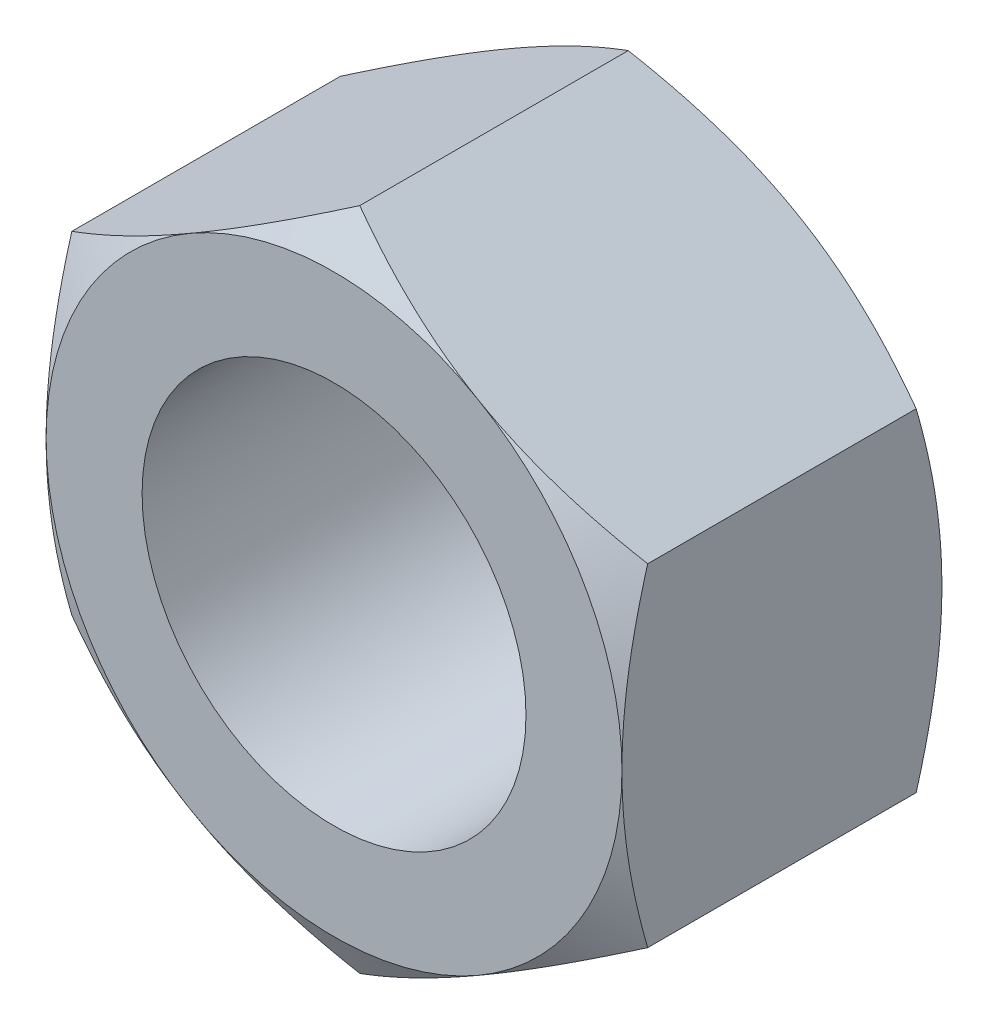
ISO-10303-21;
HEADER;
FILE_DESCRIPTION(('STEP AP214'),'2;1');
FILE_NAME('part.step','',(''),(''),'','','');
FILE_SCHEMA(('AUTOMOTIVE_DESIGN { 1 0 10303 214 1 1 1 1 }'));
ENDSEC;
DATA;
#1=APPLICATION_CONTEXT('core data for automotive mechanical design processes');
#2=APPLICATION_PROTOCOL_DEFINITION('international standard','automotive_design',2000,#1);
#3=PRODUCT_CONTEXT('',#1,'mechanical');
#4=PRODUCT('Part','Part','',(#3));
#5=PRODUCT_RELATED_PRODUCT_CATEGORY('part','',(#4));
#6=PRODUCT_DEFINITION_FORMATION('','',#4);
#7=PRODUCT_DEFINITION_CONTEXT('part definition',#1,'design');
#8=PRODUCT_DEFINITION('design','',#6,#7);
#9=PRODUCT_DEFINITION_SHAPE('','',#8);
#10=(LENGTH_UNIT() NAMED_UNIT(*) SI_UNIT(.MILLI.,.METRE.));
#11=(NAMED_UNIT(*) PLANE_ANGLE_UNIT() SI_UNIT($,.RADIAN.));
#12=(NAMED_UNIT(*) SI_UNIT($,.STERADIAN.) SOLID_ANGLE_UNIT());
#13=UNCERTAINTY_MEASURE_WITH_UNIT(LENGTH_MEASURE(1.E-05),#10,'distance_accuracy_value','');
#14=(GEOMETRIC_REPRESENTATION_CONTEXT(3) GLOBAL_UNCERTAINTY_ASSIGNED_CONTEXT((#13)) GLOBAL_UNIT_ASSIGNED_CONTEXT((#10,
#11,#12)) REPRESENTATION_CONTEXT('',''));
#15=CARTESIAN_POINT('',(0.,0.,0.));
#16=DIRECTION('',(0.,0.,1.));
#17=DIRECTION('',(1.,0.,0.));
#18=AXIS2_PLACEMENT_3D('',#15,#16,#17);
#19=CARTESIAN_POINT('',(9.,15.5884572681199,0.));
#20=DIRECTION('',(0.,0.,-1.));
#21=DIRECTION('',(1.,0.,0.));
#22=AXIS2_PLACEMENT_3D('',#19,#20,#21);
#23=PLANE('',#22);
#24=CARTESIAN_POINT('',(0.,0.,0.));
#25=DIRECTION('',(0.,0.,-1.));
#26=DIRECTION('',(-1.,0.,0.));
#27=AXIS2_PLACEMENT_3D('',#24,#25,#26);
#28=CIRCLE('',#27,6.);
#29=CARTESIAN_POINT('',(-6.,0.,0.));
#30=VERTEX_POINT('',#29);
#31=EDGE_CURVE('E303',#30,#30,#28,.T.);
#32=ORIENTED_EDGE('',*,*,#31,.T.);
#33=EDGE_LOOP('',(#32));
#34=FACE_BOUND('',#33,.T.);
#35=CARTESIAN_POINT('',(0.,0.,0.));
#36=DIRECTION('',(0.,0.,1.));
#37=DIRECTION('',(1.,0.,0.));
#38=AXIS2_PLACEMENT_3D('',#35,#36,#37);
#39=CIRCLE('',#38,9.);
#40=CARTESIAN_POINT('',(9.,0.,0.));
#41=VERTEX_POINT('',#40);
#42=CARTESIAN_POINT('',(4.5,7.79422863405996,0.));
#43=VERTEX_POINT('',#42);
#44=EDGE_CURVE('E152',#41,#43,#39,.T.);
#45=ORIENTED_EDGE('',*,*,#44,.T.);
#46=CARTESIAN_POINT('',(0.,0.,0.));
#47=DIRECTION('',(0.,0.,1.));
#48=DIRECTION('',(1.,0.,0.));
#49=AXIS2_PLACEMENT_3D('',#46,#47,#48);
#50=CIRCLE('',#49,9.);
#51=CARTESIAN_POINT('',(-4.5,7.79422863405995,0.));
#52=VERTEX_POINT('',#51);
#53=EDGE_CURVE('E138',#52,#43,#50,.F.);
#54=ORIENTED_EDGE('',*,*,#53,.F.);
#55=CARTESIAN_POINT('',(-9.,0.,0.));
#56=VERTEX_POINT('',#55);
#57=EDGE_CURVE('E143',#56,#52,#50,.F.);
#58=ORIENTED_EDGE('',*,*,#57,.F.);
#59=CARTESIAN_POINT('',(-4.5,-7.79422863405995,0.));
#60=VERTEX_POINT('',#59);
#61=EDGE_CURVE('E149',#60,#56,#50,.F.);
#62=ORIENTED_EDGE('',*,*,#61,.F.);
#63=CARTESIAN_POINT('',(4.5,-7.79422863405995,0.));
#64=VERTEX_POINT('',#63);
#65=EDGE_CURVE('E158',#64,#60,#50,.F.);
#66=ORIENTED_EDGE('',*,*,#65,.F.);
#67=EDGE_CURVE('E153',#41,#64,#50,.F.);
#68=ORIENTED_EDGE('',*,*,#67,.F.);
#69=EDGE_LOOP('',(#45,#54,#58,#62,#66,#68));
#70=FACE_BOUND('',#69,.T.);
#71=ADVANCED_FACE('F33',(#34,#70),#23,.F.);
#72=CARTESIAN_POINT('',(0.,0.,0.));
#73=DIRECTION('',(0.,0.,-1.));
#74=DIRECTION('',(1.,0.,0.));
#75=AXIS2_PLACEMENT_3D('',#72,#73,#74);
#76=CONICAL_SURFACE('',#75,9.,1.0471975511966);
#77=CARTESIAN_POINT('',(9.,-14.017615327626,-4.42142765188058));
#78=CARTESIAN_POINT('',(9.,-13.6239629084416,-4.23023000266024));
#79=CARTESIAN_POINT('',(9.,-13.2294131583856,-4.04084853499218));
#80=CARTESIAN_POINT('',(9.,-12.438041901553,-3.66673841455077));
#81=CARTESIAN_POINT('',(9.,-12.0412200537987,-3.48201048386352));
#82=CARTESIAN_POINT('',(9.,-11.2428123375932,-3.11731167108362));
#83=CARTESIAN_POINT('',(9.,-10.8412123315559,-2.93737163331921));
#84=CARTESIAN_POINT('',(9.,-10.0348385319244,-2.5847771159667));
#85=CARTESIAN_POINT('',(9.,-9.63006488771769,-2.41212229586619));
#86=CARTESIAN_POINT('',(9.,-8.80351912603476,-2.07057349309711));
#87=CARTESIAN_POINT('',(9.,-8.3816211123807,-1.90198250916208));
#88=CARTESIAN_POINT('',(9.,-7.53291280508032,-1.57741513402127));
#89=CARTESIAN_POINT('',(9.,-7.10610196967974,-1.42144014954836));
#90=CARTESIAN_POINT('',(9.,-6.24766283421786,-1.12615497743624));
#91=CARTESIAN_POINT('',(9.,-5.81604607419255,-0.986811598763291));
#92=CARTESIAN_POINT('',(9.,-4.94663740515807,-0.729218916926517));
#93=CARTESIAN_POINT('',(9.,-4.50884746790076,-0.610963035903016));
#94=CARTESIAN_POINT('',(9.,-3.62915356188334,-0.401804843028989));
#95=CARTESIAN_POINT('',(9.,-3.18728550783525,-0.310755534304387));
#96=CARTESIAN_POINT('',(9.,-2.52041255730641,-0.19851098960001));
#97=CARTESIAN_POINT('',(9.,-2.29742752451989,-0.165149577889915));
#98=CARTESIAN_POINT('',(9.,-1.85032876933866,-0.107189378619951));
#99=CARTESIAN_POINT('',(9.,-1.62621515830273,-0.0825897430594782));
#100=CARTESIAN_POINT('',(9.,-1.18011550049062,-0.0429550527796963));
#101=CARTESIAN_POINT('',(9.,-0.958140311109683,-0.0277982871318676));
#102=CARTESIAN_POINT('',(9.,-0.513747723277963,-0.00688835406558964));
#103=CARTESIAN_POINT('',(9.,-0.291330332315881,-0.00113502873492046));
#104=CARTESIAN_POINT('',(9.,0.153550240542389,0.000830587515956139));
#105=CARTESIAN_POINT('',(9.,0.37601342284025,-0.00295720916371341));
#106=CARTESIAN_POINT('',(9.,0.820580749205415,-0.0199805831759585));
#107=CARTESIAN_POINT('',(9.,1.04268487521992,-0.0332166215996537));
#108=CARTESIAN_POINT('',(9.,1.57455430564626,-0.0759441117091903));
#109=CARTESIAN_POINT('',(9.,1.88397562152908,-0.109811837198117));
#110=CARTESIAN_POINT('',(9.,2.50054740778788,-0.19405151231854));
#111=CARTESIAN_POINT('',(9.,2.80769757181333,-0.244425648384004));
#112=CARTESIAN_POINT('',(9.,3.72536724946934,-0.417638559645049));
#113=CARTESIAN_POINT('',(9.,4.33177923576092,-0.562538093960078));
#114=CARTESIAN_POINT('',(9.,5.23880841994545,-0.814187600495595));
#115=CARTESIAN_POINT('',(9.,5.54411698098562,-0.905003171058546));
#116=CARTESIAN_POINT('',(9.,6.15176849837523,-1.09615446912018));
#117=CARTESIAN_POINT('',(9.,6.45411143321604,-1.19649026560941));
#118=CARTESIAN_POINT('',(9.,7.05592793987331,-1.405064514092));
#119=CARTESIAN_POINT('',(9.,7.35540237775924,-1.51330048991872));
#120=CARTESIAN_POINT('',(9.,7.95186115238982,-1.7363925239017));
#121=CARTESIAN_POINT('',(9.,8.24884553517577,-1.85124845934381));
#122=CARTESIAN_POINT('',(9.,9.01408500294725,-2.15543672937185));
#123=CARTESIAN_POINT('',(9.,9.48067410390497,-2.34895505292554));
#124=CARTESIAN_POINT('',(9.,10.4093625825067,-2.74651548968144));
#125=CARTESIAN_POINT('',(9.,10.8714615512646,-2.95055855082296));
#126=CARTESIAN_POINT('',(9.,11.7921369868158,-3.36680145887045));
#127=CARTESIAN_POINT('',(9.,12.2507122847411,-3.57900388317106));
#128=CARTESIAN_POINT('',(9.,13.1648648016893,-4.00971421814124));
#129=CARTESIAN_POINT('',(9.,13.6204421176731,-4.22822192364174));
#130=CARTESIAN_POINT('',(9.,14.5297988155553,-4.67054253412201));
#131=CARTESIAN_POINT('',(9.,14.9835747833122,-4.89436244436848));
#132=CARTESIAN_POINT('',(9.,15.8891229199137,-5.3460208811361));
#133=CARTESIAN_POINT('',(9.,16.3408950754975,-5.57385943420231));
#134=CARTESIAN_POINT('',(9.,17.2426948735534,-6.03275625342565));
#135=CARTESIAN_POINT('',(9.,17.6927228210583,-6.26381392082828));
#136=CARTESIAN_POINT('',(9.,18.5913917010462,-6.72861248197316));
#137=CARTESIAN_POINT('',(9.,19.0400326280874,-6.9623533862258));
#138=CARTESIAN_POINT('',(9.,20.2963611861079,-7.62085428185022));
#139=CARTESIAN_POINT('',(9.,21.1027390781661,-8.04811270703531));
#140=CARTESIAN_POINT('',(9.,22.7127172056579,-8.9079170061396));
#141=CARTESIAN_POINT('',(9.,23.5163172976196,-9.34046314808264));
#142=CARTESIAN_POINT('',(9.,25.1189544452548,-10.2082276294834));
#143=CARTESIAN_POINT('',(9.,25.9179979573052,-10.6434340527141));
#144=CARTESIAN_POINT('',(9.,27.1152823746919,-11.2985174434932));
#145=CARTESIAN_POINT('',(9.,27.5141502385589,-11.517250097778));
#146=CARTESIAN_POINT('',(9.,28.3115117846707,-11.9553951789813));
#147=CARTESIAN_POINT('',(9.,28.7100054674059,-12.1748076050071));
#148=CARTESIAN_POINT('',(9.,29.1083344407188,-12.3945187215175));
#149=B_SPLINE_CURVE_WITH_KNOTS('',3,(#77,#78,#79,#80,#81,#82,#83,#84,#85,#86,#87,#88,#89,#90,
#91,#92,#93,#94,#95,#96,#97,#98,#99,#100,#101,#102,#103,#104,#105,#106,#107,#108,#109,#110,#111,
#112,#113,#114,#115,#116,#117,#118,#119,#120,#121,#122,#123,#124,#125,#126,#127,#128,#129,#130,
#131,#132,#133,#134,#135,#136,#137,#138,#139,#140,#141,#142,#143,#144,#145,#146,#147,#148),
.UNSPECIFIED.,.F.,.F.,(4,2,2,2,2,2,2,2,2,2,2,2,2,2,2,2,2,2,2,2,2,2,2,2,2,2,2,2,2,2,2,2,2,2,2,4),
(0.,1.31290146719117,2.62600541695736,3.94615527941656,5.2662433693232,6.62909361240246,
7.99209560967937,9.35233035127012,10.7121400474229,12.0644640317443,12.7407196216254,
13.4169097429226,14.0841935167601,14.7514660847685,15.418744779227,16.0860560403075,
17.0193381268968,17.9527438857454,19.820535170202,20.7760411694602,21.7315540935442,
22.6867688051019,23.6419658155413,25.1571640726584,26.6724990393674,28.1883166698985,
29.7040850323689,31.2219774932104,32.7398799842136,34.2575038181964,35.7751335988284,
38.5128314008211,41.2506685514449,43.9802886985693,45.3450064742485,46.7097224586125),.UNSPECIFIED.);
#150=CARTESIAN_POINT('',(9.,5.19615242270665,-0.803847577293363));
#151=VERTEX_POINT('',#150);
#152=EDGE_CURVE('E141',#151,#41,#149,.F.);
#153=ORIENTED_EDGE('',*,*,#152,.F.);
#154=CARTESIAN_POINT('',(-0.0002,10.3924203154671,-0.803914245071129));
#155=CARTESIAN_POINT('',(0.197607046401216,10.2782163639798,-0.737982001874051));
#156=CARTESIAN_POINT('',(0.396185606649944,10.1635669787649,-0.67504140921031));
#157=CARTESIAN_POINT('',(0.794955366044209,9.93333715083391,-0.555968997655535));
#158=CARTESIAN_POINT('',(0.99514722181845,9.81775632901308,-0.499840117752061));
#159=CARTESIAN_POINT('',(1.3975150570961,9.58544915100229,-0.395151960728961));
#160=CARTESIAN_POINT('',(1.5996945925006,9.46872074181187,-0.346610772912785));
#161=CARTESIAN_POINT('',(2.00542875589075,9.23447001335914,-0.258148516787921));
#162=CARTESIAN_POINT('',(2.20898309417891,9.11694786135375,-0.218225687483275));
#163=CARTESIAN_POINT('',(2.61230590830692,8.88408932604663,-0.148684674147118));
#164=CARTESIAN_POINT('',(2.81204459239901,8.76877014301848,-0.118837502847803));
#165=CARTESIAN_POINT('',(3.212415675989,8.53761579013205,-0.0687933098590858));
#166=CARTESIAN_POINT('',(3.41304799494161,8.42178066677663,-0.0485954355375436));
#167=CARTESIAN_POINT('',(3.81466063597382,8.18990950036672,-0.0183543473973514));
#168=CARTESIAN_POINT('',(4.01564030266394,8.07387383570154,-0.00829960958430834));
#169=CARTESIAN_POINT('',(4.41778459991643,7.84169571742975,0.00143766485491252));
#170=CARTESIAN_POINT('',(4.61894922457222,7.72555326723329,0.00112052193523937));
#171=CARTESIAN_POINT('',(4.9950326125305,7.50842142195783,-0.00916395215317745));
#172=CARTESIAN_POINT('',(5.16997789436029,7.40741671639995,-0.0178767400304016));
#173=CARTESIAN_POINT('',(5.51945867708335,7.20564389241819,-0.0429773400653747));
#174=CARTESIAN_POINT('',(5.69399414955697,7.10487579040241,-0.0593656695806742));
#175=CARTESIAN_POINT('',(6.21692487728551,6.80296159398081,-0.119656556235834));
#176=CARTESIAN_POINT('',(6.56439451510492,6.60234990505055,-0.174677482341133));
#177=CARTESIAN_POINT('',(7.263019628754,6.19899850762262,-0.312230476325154));
#178=CARTESIAN_POINT('',(7.61408594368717,5.99631027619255,-0.39534561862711));
#179=CARTESIAN_POINT('',(8.31098330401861,5.59395639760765,-0.583982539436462));
#180=CARTESIAN_POINT('',(8.65682327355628,5.39428559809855,-0.689460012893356));
#181=CARTESIAN_POINT('',(9.0002,5.19603695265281,-0.803914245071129));
#182=B_SPLINE_CURVE_WITH_KNOTS('',3,(#154,#155,#156,#157,#158,#159,#160,#161,#162,#163,#164,
#165,#166,#167,#168,#169,#170,#171,#172,#173,#174,#175,#176,#177,#178,#179,#180,#181),
.UNSPECIFIED.,.F.,.F.,(4,2,2,2,2,2,2,2,2,2,2,2,2,4),(0.,0.713219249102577,1.42674513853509,
2.14194697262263,2.8570025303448,3.55449749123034,4.25193080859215,4.94857085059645,
5.64518936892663,6.25162976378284,6.8581110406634,8.07193747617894,9.31268391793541,
10.5509947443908),.UNSPECIFIED.);
#183=EDGE_CURVE('E180',#43,#151,#182,.T.);
#184=ORIENTED_EDGE('',*,*,#183,.F.);
#185=ORIENTED_EDGE('',*,*,#44,.F.);
#186=EDGE_LOOP('',(#153,#184,#185));
#187=FACE_BOUND('',#186,.T.);
#188=ADVANCED_FACE('F177',(#187),#76,.T.);
#189=CARTESIAN_POINT('',(-9.0002,5.19603695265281,-0.803914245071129));
#190=CARTESIAN_POINT('',(-8.80239295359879,5.31024090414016,-0.737982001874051));
#191=CARTESIAN_POINT('',(-8.60381439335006,5.42489028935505,-0.675041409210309));
#192=CARTESIAN_POINT('',(-8.20504463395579,5.65512011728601,-0.555968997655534));
#193=CARTESIAN_POINT('',(-8.00485277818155,5.77070093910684,-0.499840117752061));
#194=CARTESIAN_POINT('',(-7.6024849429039,6.00300811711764,-0.395151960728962));
#195=CARTESIAN_POINT('',(-7.4003054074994,6.11973652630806,-0.346610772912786));
#196=CARTESIAN_POINT('',(-6.99457124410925,6.35398725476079,-0.258148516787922));
#197=CARTESIAN_POINT('',(-6.79101690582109,6.47150940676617,-0.218225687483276));
#198=CARTESIAN_POINT('',(-6.38769409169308,6.70436794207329,-0.148684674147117));
#199=CARTESIAN_POINT('',(-6.187955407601,6.81968712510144,-0.118837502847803));
#200=CARTESIAN_POINT('',(-5.787584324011,7.05084147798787,-0.0687933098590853));
#201=CARTESIAN_POINT('',(-5.58695200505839,7.1666766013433,-0.0485954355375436));
#202=CARTESIAN_POINT('',(-5.18533936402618,7.3985477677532,-0.0183543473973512));
#203=CARTESIAN_POINT('',(-4.98435969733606,7.51458343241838,-0.00829960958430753));
#204=CARTESIAN_POINT('',(-4.58221540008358,7.74676155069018,0.00143766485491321));
#205=CARTESIAN_POINT('',(-4.38105077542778,7.86290400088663,0.00112052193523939));
#206=CARTESIAN_POINT('',(-4.0049673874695,8.08003584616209,-0.00916395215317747));
#207=CARTESIAN_POINT('',(-3.83002210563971,8.18104055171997,-0.0178767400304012));
#208=CARTESIAN_POINT('',(-3.48054132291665,8.38281337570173,-0.0429773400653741));
#209=CARTESIAN_POINT('',(-3.30600585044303,8.48358147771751,-0.0593656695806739));
#210=CARTESIAN_POINT('',(-2.7830751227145,8.78549567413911,-0.119656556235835));
#211=CARTESIAN_POINT('',(-2.43560548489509,8.98610736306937,-0.174677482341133));
#212=CARTESIAN_POINT('',(-1.736980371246,9.3894587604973,-0.312230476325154));
#213=CARTESIAN_POINT('',(-1.38591405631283,9.59214699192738,-0.395345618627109));
#214=CARTESIAN_POINT('',(-0.689016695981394,9.99450087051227,-0.583982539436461));
#215=CARTESIAN_POINT('',(-0.343176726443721,10.1941716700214,-0.689460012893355));
#216=CARTESIAN_POINT('',(0.000199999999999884,10.3924203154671,-0.803914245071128));
#217=B_SPLINE_CURVE_WITH_KNOTS('',3,(#189,#190,#191,#192,#193,#194,#195,#196,#197,#198,#199,
#200,#201,#202,#203,#204,#205,#206,#207,#208,#209,#210,#211,#212,#213,#214,#215,#216),
.UNSPECIFIED.,.F.,.F.,(4,2,2,2,2,2,2,2,2,2,2,2,2,4),(0.,0.713219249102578,1.42674513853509,
2.14194697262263,2.85700253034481,3.55449749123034,4.25193080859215,4.94857085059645,
5.64518936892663,6.25162976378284,6.8581110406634,8.07193747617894,9.31268391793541,
10.5509947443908),.UNSPECIFIED.);
#218=CARTESIAN_POINT('',(0.,10.3923048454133,-0.803847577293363));
#219=VERTEX_POINT('',#218);
#220=EDGE_CURVE('E123',#52,#219,#217,.T.);
#221=ORIENTED_EDGE('',*,*,#220,.F.);
#222=ORIENTED_EDGE('',*,*,#53,.T.);
#223=EDGE_CURVE('E140',#219,#43,#182,.T.);
#224=ORIENTED_EDGE('',*,*,#223,.F.);
#225=EDGE_LOOP('',(#221,#222,#224));
#226=FACE_BOUND('',#225,.T.);
#227=ADVANCED_FACE('F136',(#226),#76,.T.);
#228=CARTESIAN_POINT('',(-9.,-14.017615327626,-4.42142765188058));
#229=CARTESIAN_POINT('',(-9.,-13.6239629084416,-4.23023000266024));
#230=CARTESIAN_POINT('',(-9.,-13.2294131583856,-4.04084853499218));
#231=CARTESIAN_POINT('',(-9.,-12.438041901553,-3.66673841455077));
#232=CARTESIAN_POINT('',(-9.,-12.0412200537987,-3.48201048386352));
#233=CARTESIAN_POINT('',(-9.,-11.2428123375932,-3.11731167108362));
#234=CARTESIAN_POINT('',(-9.,-10.8412123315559,-2.93737163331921));
#235=CARTESIAN_POINT('',(-9.,-10.0348385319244,-2.5847771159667));
#236=CARTESIAN_POINT('',(-9.,-9.63006488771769,-2.41212229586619));
#237=CARTESIAN_POINT('',(-9.,-8.80351912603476,-2.07057349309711));
#238=CARTESIAN_POINT('',(-9.,-8.3816211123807,-1.90198250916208));
#239=CARTESIAN_POINT('',(-9.,-7.53291280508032,-1.57741513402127));
#240=CARTESIAN_POINT('',(-9.,-7.10610196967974,-1.42144014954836));
#241=CARTESIAN_POINT('',(-9.,-6.24766283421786,-1.12615497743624));
#242=CARTESIAN_POINT('',(-9.,-5.81604607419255,-0.986811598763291));
#243=CARTESIAN_POINT('',(-9.,-4.94663740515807,-0.729218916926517));
#244=CARTESIAN_POINT('',(-9.,-4.50884746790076,-0.610963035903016));
#245=CARTESIAN_POINT('',(-9.,-3.62915356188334,-0.401804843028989));
#246=CARTESIAN_POINT('',(-9.,-3.18728550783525,-0.310755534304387));
#247=CARTESIAN_POINT('',(-9.,-2.52041255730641,-0.19851098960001));
#248=CARTESIAN_POINT('',(-9.,-2.29742752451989,-0.165149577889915));
#249=CARTESIAN_POINT('',(-9.,-1.85032876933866,-0.107189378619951));
#250=CARTESIAN_POINT('',(-9.,-1.62621515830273,-0.0825897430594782));
#251=CARTESIAN_POINT('',(-9.,-1.18011550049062,-0.0429550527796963));
#252=CARTESIAN_POINT('',(-9.,-0.958140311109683,-0.0277982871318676));
#253=CARTESIAN_POINT('',(-9.,-0.513747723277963,-0.00688835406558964));
#254=CARTESIAN_POINT('',(-9.,-0.291330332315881,-0.00113502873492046));
#255=CARTESIAN_POINT('',(-9.,0.153550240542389,0.000830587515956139));
#256=CARTESIAN_POINT('',(-9.,0.37601342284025,-0.00295720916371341));
#257=CARTESIAN_POINT('',(-9.,0.820580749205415,-0.0199805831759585));
#258=CARTESIAN_POINT('',(-9.,1.04268487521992,-0.0332166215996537));
#259=CARTESIAN_POINT('',(-9.,1.57455430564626,-0.0759441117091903));
#260=CARTESIAN_POINT('',(-9.,1.88397562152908,-0.109811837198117));
#261=CARTESIAN_POINT('',(-9.,2.50054740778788,-0.19405151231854));
#262=CARTESIAN_POINT('',(-9.,2.80769757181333,-0.244425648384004));
#263=CARTESIAN_POINT('',(-9.,3.72536724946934,-0.417638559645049));
#264=CARTESIAN_POINT('',(-9.,4.33177923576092,-0.562538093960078));
#265=CARTESIAN_POINT('',(-9.,5.23880841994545,-0.814187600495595));
#266=CARTESIAN_POINT('',(-9.,5.54411698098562,-0.905003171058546));
#267=CARTESIAN_POINT('',(-9.,6.15176849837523,-1.09615446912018));
#268=CARTESIAN_POINT('',(-9.,6.45411143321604,-1.19649026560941));
#269=CARTESIAN_POINT('',(-9.,7.05592793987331,-1.405064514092));
#270=CARTESIAN_POINT('',(-9.,7.35540237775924,-1.51330048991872));
#271=CARTESIAN_POINT('',(-9.,7.95186115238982,-1.7363925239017));
#272=CARTESIAN_POINT('',(-9.,8.24884553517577,-1.85124845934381));
#273=CARTESIAN_POINT('',(-9.,9.01408500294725,-2.15543672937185));
#274=CARTESIAN_POINT('',(-9.,9.48067410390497,-2.34895505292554));
#275=CARTESIAN_POINT('',(-9.,10.4093625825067,-2.74651548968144));
#276=CARTESIAN_POINT('',(-9.,10.8714615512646,-2.95055855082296));
#277=CARTESIAN_POINT('',(-9.,11.7921369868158,-3.36680145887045));
#278=CARTESIAN_POINT('',(-9.,12.2507122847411,-3.57900388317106));
#279=CARTESIAN_POINT('',(-9.,13.1648648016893,-4.00971421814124));
#280=CARTESIAN_POINT('',(-9.,13.6204421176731,-4.22822192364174));
#281=CARTESIAN_POINT('',(-9.,14.5297988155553,-4.67054253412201));
#282=CARTESIAN_POINT('',(-9.,14.9835747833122,-4.89436244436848));
#283=CARTESIAN_POINT('',(-9.,15.8891229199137,-5.3460208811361));
#284=CARTESIAN_POINT('',(-9.,16.3408950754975,-5.57385943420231));
#285=CARTESIAN_POINT('',(-9.,17.2426948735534,-6.03275625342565));
#286=CARTESIAN_POINT('',(-9.,17.6927228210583,-6.26381392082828));
#287=CARTESIAN_POINT('',(-9.,18.5913917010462,-6.72861248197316));
#288=CARTESIAN_POINT('',(-9.,19.0400326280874,-6.9623533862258));
#289=CARTESIAN_POINT('',(-9.,20.2963611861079,-7.62085428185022));
#290=CARTESIAN_POINT('',(-9.,21.1027390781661,-8.04811270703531));
#291=CARTESIAN_POINT('',(-9.,22.7127172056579,-8.9079170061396));
#292=CARTESIAN_POINT('',(-9.,23.5163172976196,-9.34046314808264));
#293=CARTESIAN_POINT('',(-9.,25.1189544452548,-10.2082276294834));
#294=CARTESIAN_POINT('',(-9.,25.9179979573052,-10.6434340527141));
#295=CARTESIAN_POINT('',(-9.,27.1152823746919,-11.2985174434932));
#296=CARTESIAN_POINT('',(-9.,27.5141502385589,-11.517250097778));
#297=CARTESIAN_POINT('',(-9.,28.3115117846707,-11.9553951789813));
#298=CARTESIAN_POINT('',(-9.,28.7100054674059,-12.1748076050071));
#299=CARTESIAN_POINT('',(-9.,29.1083344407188,-12.3945187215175));
#300=B_SPLINE_CURVE_WITH_KNOTS('',3,(#228,#229,#230,#231,#232,#233,#234,#235,#236,#237,#238,
#239,#240,#241,#242,#243,#244,#245,#246,#247,#248,#249,#250,#251,#252,#253,#254,#255,#256,#257,
#258,#259,#260,#261,#262,#263,#264,#265,#266,#267,#268,#269,#270,#271,#272,#273,#274,#275,#276,
#277,#278,#279,#280,#281,#282,#283,#284,#285,#286,#287,#288,#289,#290,#291,#292,#293,#294,#295,
#296,#297,#298,#299),.UNSPECIFIED.,.F.,.F.,(4,2,2,2,2,2,2,2,2,2,2,2,2,2,2,2,2,2,2,2,2,2,2,2,2,2,
2,2,2,2,2,2,2,2,2,4),(0.,1.31290146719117,2.62600541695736,3.94615527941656,5.2662433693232,
6.62909361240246,7.99209560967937,9.35233035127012,10.7121400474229,12.0644640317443,
12.7407196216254,13.4169097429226,14.0841935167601,14.7514660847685,15.418744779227,
16.0860560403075,17.0193381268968,17.9527438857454,19.820535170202,20.7760411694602,
21.7315540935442,22.6867688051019,23.6419658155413,25.1571640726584,26.6724990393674,
28.1883166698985,29.7040850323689,31.2219774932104,32.7398799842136,34.2575038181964,
35.7751335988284,38.5128314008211,41.2506685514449,43.9802886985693,45.3450064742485,
46.7097224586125),.UNSPECIFIED.);
#301=CARTESIAN_POINT('',(-9.,5.19615242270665,-0.803847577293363));
#302=VERTEX_POINT('',#301);
#303=EDGE_CURVE('E145',#56,#302,#300,.T.);
#304=ORIENTED_EDGE('',*,*,#303,.F.);
#305=ORIENTED_EDGE('',*,*,#57,.T.);
#306=EDGE_CURVE('E119',#302,#52,#217,.T.);
#307=ORIENTED_EDGE('',*,*,#306,.F.);
#308=EDGE_LOOP('',(#304,#305,#307));
#309=FACE_BOUND('',#308,.T.);
#310=ADVANCED_FACE('F144',(#309),#76,.T.);
#311=CARTESIAN_POINT('',(0.0002,-10.3924203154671,-0.803914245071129));
#312=CARTESIAN_POINT('',(-0.197607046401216,-10.2782163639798,-0.737982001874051));
#313=CARTESIAN_POINT('',(-0.396185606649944,-10.1635669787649,-0.67504140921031));
#314=CARTESIAN_POINT('',(-0.794955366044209,-9.93333715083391,-0.555968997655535));
#315=CARTESIAN_POINT('',(-0.99514722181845,-9.81775632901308,-0.499840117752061));
#316=CARTESIAN_POINT('',(-1.3975150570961,-9.58544915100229,-0.395151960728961));
#317=CARTESIAN_POINT('',(-1.5996945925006,-9.46872074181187,-0.346610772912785));
#318=CARTESIAN_POINT('',(-2.00542875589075,-9.23447001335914,-0.258148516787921));
#319=CARTESIAN_POINT('',(-2.20898309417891,-9.11694786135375,-0.218225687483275));
#320=CARTESIAN_POINT('',(-2.61230590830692,-8.88408932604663,-0.148684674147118));
#321=CARTESIAN_POINT('',(-2.81204459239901,-8.76877014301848,-0.118837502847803));
#322=CARTESIAN_POINT('',(-3.212415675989,-8.53761579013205,-0.0687933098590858));
#323=CARTESIAN_POINT('',(-3.41304799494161,-8.42178066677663,-0.0485954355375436));
#324=CARTESIAN_POINT('',(-3.81466063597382,-8.18990950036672,-0.0183543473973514));
#325=CARTESIAN_POINT('',(-4.01564030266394,-8.07387383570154,-0.00829960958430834));
#326=CARTESIAN_POINT('',(-4.41778459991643,-7.84169571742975,0.00143766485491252));
#327=CARTESIAN_POINT('',(-4.61894922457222,-7.72555326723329,0.00112052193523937));
#328=CARTESIAN_POINT('',(-4.9950326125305,-7.50842142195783,-0.00916395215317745));
#329=CARTESIAN_POINT('',(-5.16997789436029,-7.40741671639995,-0.0178767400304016));
#330=CARTESIAN_POINT('',(-5.51945867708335,-7.20564389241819,-0.0429773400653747));
#331=CARTESIAN_POINT('',(-5.69399414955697,-7.10487579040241,-0.0593656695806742));
#332=CARTESIAN_POINT('',(-6.21692487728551,-6.80296159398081,-0.119656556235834));
#333=CARTESIAN_POINT('',(-6.56439451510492,-6.60234990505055,-0.174677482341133));
#334=CARTESIAN_POINT('',(-7.263019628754,-6.19899850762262,-0.312230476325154));
#335=CARTESIAN_POINT('',(-7.61408594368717,-5.99631027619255,-0.39534561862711));
#336=CARTESIAN_POINT('',(-8.31098330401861,-5.59395639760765,-0.583982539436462));
#337=CARTESIAN_POINT('',(-8.65682327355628,-5.39428559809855,-0.689460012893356));
#338=CARTESIAN_POINT('',(-9.0002,-5.19603695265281,-0.803914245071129));
#339=B_SPLINE_CURVE_WITH_KNOTS('',3,(#311,#312,#313,#314,#315,#316,#317,#318,#319,#320,#321,
#322,#323,#324,#325,#326,#327,#328,#329,#330,#331,#332,#333,#334,#335,#336,#337,#338),
.UNSPECIFIED.,.F.,.F.,(4,2,2,2,2,2,2,2,2,2,2,2,2,4),(0.,0.713219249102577,1.42674513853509,
2.14194697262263,2.8570025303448,3.55449749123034,4.25193080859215,4.94857085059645,
5.64518936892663,6.25162976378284,6.8581110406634,8.07193747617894,9.31268391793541,
10.5509947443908),.UNSPECIFIED.);
#340=CARTESIAN_POINT('',(-9.,-5.19615242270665,-0.803847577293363));
#341=VERTEX_POINT('',#340);
#342=EDGE_CURVE('E173',#60,#341,#339,.T.);
#343=ORIENTED_EDGE('',*,*,#342,.F.);
#344=ORIENTED_EDGE('',*,*,#61,.T.);
#345=EDGE_CURVE('E171',#341,#56,#300,.T.);
#346=ORIENTED_EDGE('',*,*,#345,.F.);
#347=EDGE_LOOP('',(#343,#344,#346));
#348=FACE_BOUND('',#347,.T.);
#349=ADVANCED_FACE('F170',(#348),#76,.T.);
#350=CARTESIAN_POINT('',(0.,-10.3923048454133,-0.803847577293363));
#351=VERTEX_POINT('',#350);
#352=EDGE_CURVE('E217',#351,#60,#339,.T.);
#353=ORIENTED_EDGE('',*,*,#352,.F.);
#354=CARTESIAN_POINT('',(9.0002,-5.19603695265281,-0.803914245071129));
#355=CARTESIAN_POINT('',(8.80239295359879,-5.31024090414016,-0.737982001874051));
#356=CARTESIAN_POINT('',(8.60381439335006,-5.42489028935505,-0.675041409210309));
#357=CARTESIAN_POINT('',(8.20504463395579,-5.65512011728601,-0.555968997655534));
#358=CARTESIAN_POINT('',(8.00485277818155,-5.77070093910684,-0.499840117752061));
#359=CARTESIAN_POINT('',(7.6024849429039,-6.00300811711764,-0.395151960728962));
#360=CARTESIAN_POINT('',(7.4003054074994,-6.11973652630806,-0.346610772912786));
#361=CARTESIAN_POINT('',(6.99457124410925,-6.35398725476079,-0.258148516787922));
#362=CARTESIAN_POINT('',(6.79101690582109,-6.47150940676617,-0.218225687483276));
#363=CARTESIAN_POINT('',(6.38769409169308,-6.70436794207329,-0.148684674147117));
#364=CARTESIAN_POINT('',(6.187955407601,-6.81968712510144,-0.118837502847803));
#365=CARTESIAN_POINT('',(5.787584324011,-7.05084147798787,-0.0687933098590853));
#366=CARTESIAN_POINT('',(5.58695200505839,-7.1666766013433,-0.0485954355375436));
#367=CARTESIAN_POINT('',(5.18533936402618,-7.3985477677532,-0.0183543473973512));
#368=CARTESIAN_POINT('',(4.98435969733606,-7.51458343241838,-0.00829960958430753));
#369=CARTESIAN_POINT('',(4.58221540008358,-7.74676155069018,0.00143766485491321));
#370=CARTESIAN_POINT('',(4.38105077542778,-7.86290400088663,0.00112052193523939));
#371=CARTESIAN_POINT('',(4.0049673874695,-8.08003584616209,-0.00916395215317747));
#372=CARTESIAN_POINT('',(3.83002210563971,-8.18104055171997,-0.0178767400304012));
#373=CARTESIAN_POINT('',(3.48054132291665,-8.38281337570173,-0.0429773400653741));
#374=CARTESIAN_POINT('',(3.30600585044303,-8.48358147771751,-0.0593656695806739));
#375=CARTESIAN_POINT('',(2.7830751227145,-8.78549567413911,-0.119656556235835));
#376=CARTESIAN_POINT('',(2.43560548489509,-8.98610736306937,-0.174677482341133));
#377=CARTESIAN_POINT('',(1.736980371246,-9.3894587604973,-0.312230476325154));
#378=CARTESIAN_POINT('',(1.38591405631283,-9.59214699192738,-0.395345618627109));
#379=CARTESIAN_POINT('',(0.689016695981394,-9.99450087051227,-0.583982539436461));
#380=CARTESIAN_POINT('',(0.343176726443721,-10.1941716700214,-0.689460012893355));
#381=CARTESIAN_POINT('',(-0.000199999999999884,-10.3924203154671,-0.803914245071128));
#382=B_SPLINE_CURVE_WITH_KNOTS('',3,(#354,#355,#356,#357,#358,#359,#360,#361,#362,#363,#364,
#365,#366,#367,#368,#369,#370,#371,#372,#373,#374,#375,#376,#377,#378,#379,#380,#381),
.UNSPECIFIED.,.F.,.F.,(4,2,2,2,2,2,2,2,2,2,2,2,2,4),(0.,0.713219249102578,1.42674513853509,
2.14194697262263,2.85700253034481,3.55449749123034,4.25193080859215,4.94857085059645,
5.64518936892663,6.25162976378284,6.8581110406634,8.07193747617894,9.31268391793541,
10.5509947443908),.UNSPECIFIED.);
#383=EDGE_CURVE('E279',#64,#351,#382,.T.);
#384=ORIENTED_EDGE('',*,*,#383,.F.);
#385=ORIENTED_EDGE('',*,*,#65,.T.);
#386=EDGE_LOOP('',(#353,#384,#385));
#387=FACE_BOUND('',#386,.T.);
#388=ADVANCED_FACE('F300',(#387),#76,.T.);
#389=CARTESIAN_POINT('',(9.,-5.19615242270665,-0.803847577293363));
#390=VERTEX_POINT('',#389);
#391=EDGE_CURVE('E275',#390,#64,#382,.T.);
#392=ORIENTED_EDGE('',*,*,#391,.F.);
#393=EDGE_CURVE('E131',#41,#390,#149,.F.);
#394=ORIENTED_EDGE('',*,*,#393,.F.);
#395=ORIENTED_EDGE('',*,*,#67,.T.);
#396=EDGE_LOOP('',(#392,#394,#395));
#397=FACE_BOUND('',#396,.T.);
#398=ADVANCED_FACE('F358',(#397),#76,.T.);
#399=CARTESIAN_POINT('',(-9.,5.19615242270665,-10.));
#400=DIRECTION('',(-0.499999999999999,0.866025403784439,0.));
#401=DIRECTION('',(0.866025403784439,0.499999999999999,0.));
#402=AXIS2_PLACEMENT_3D('',#399,#400,#401);
#403=PLANE('',#402);
#404=CARTESIAN_POINT('',(0.0002,10.3924203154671,-9.19608575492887));
#405=CARTESIAN_POINT('',(-0.197607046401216,10.2782163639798,-9.26201799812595));
#406=CARTESIAN_POINT('',(-0.396185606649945,10.1635669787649,-9.32495859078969));
#407=CARTESIAN_POINT('',(-0.79495536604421,9.93333715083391,-9.44403100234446));
#408=CARTESIAN_POINT('',(-0.995147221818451,9.81775632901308,-9.50015988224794));
#409=CARTESIAN_POINT('',(-1.3975150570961,9.58544915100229,-9.60484803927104));
#410=CARTESIAN_POINT('',(-1.5996945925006,9.46872074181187,-9.65338922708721));
#411=CARTESIAN_POINT('',(-2.00542875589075,9.23447001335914,-9.74185148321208));
#412=CARTESIAN_POINT('',(-2.20898309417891,9.11694786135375,-9.78177431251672));
#413=CARTESIAN_POINT('',(-2.61230590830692,8.88408932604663,-9.85131532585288));
#414=CARTESIAN_POINT('',(-2.81204459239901,8.76877014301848,-9.8811624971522));
#415=CARTESIAN_POINT('',(-3.212415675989,8.53761579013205,-9.93120669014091));
#416=CARTESIAN_POINT('',(-3.41304799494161,8.42178066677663,-9.95140456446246));
#417=CARTESIAN_POINT('',(-3.81466063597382,8.18990950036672,-9.98164565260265));
#418=CARTESIAN_POINT('',(-4.01564030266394,8.07387383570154,-9.99170039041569));
#419=CARTESIAN_POINT('',(-4.41778459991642,7.84169571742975,-10.0014376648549));
#420=CARTESIAN_POINT('',(-4.61894922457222,7.72555326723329,-10.0011205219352));
#421=CARTESIAN_POINT('',(-4.9950326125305,7.50842142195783,-9.99083604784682));
#422=CARTESIAN_POINT('',(-5.16997789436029,7.40741671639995,-9.9821232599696));
#423=CARTESIAN_POINT('',(-5.51945867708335,7.20564389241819,-9.95702265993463));
#424=CARTESIAN_POINT('',(-5.69399414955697,7.10487579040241,-9.94063433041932));
#425=CARTESIAN_POINT('',(-6.21692487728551,6.80296159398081,-9.88034344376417));
#426=CARTESIAN_POINT('',(-6.56439451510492,6.60234990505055,-9.82532251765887));
#427=CARTESIAN_POINT('',(-7.263019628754,6.19899850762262,-9.68776952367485));
#428=CARTESIAN_POINT('',(-7.61408594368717,5.99631027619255,-9.60465438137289));
#429=CARTESIAN_POINT('',(-8.3109833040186,5.59395639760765,-9.41601746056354));
#430=CARTESIAN_POINT('',(-8.65682327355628,5.39428559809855,-9.31053998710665));
#431=CARTESIAN_POINT('',(-9.0002,5.19603695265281,-9.19608575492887));
#432=B_SPLINE_CURVE_WITH_KNOTS('',3,(#404,#405,#406,#407,#408,#409,#410,#411,#412,#413,#414,
#415,#416,#417,#418,#419,#420,#421,#422,#423,#424,#425,#426,#427,#428,#429,#430,#431),
.UNSPECIFIED.,.F.,.F.,(4,2,2,2,2,2,2,2,2,2,2,2,2,4),(0.,0.713219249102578,1.42674513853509,
2.14194697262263,2.8570025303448,3.55449749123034,4.25193080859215,4.94857085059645,
5.64518936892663,6.25162976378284,6.8581110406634,8.07193747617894,9.31268391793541,
10.5509947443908),.UNSPECIFIED.);
#433=CARTESIAN_POINT('',(0.,10.3923048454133,-9.19615242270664));
#434=VERTEX_POINT('',#433);
#435=CARTESIAN_POINT('',(-4.5,7.79422863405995,-10.));
#436=VERTEX_POINT('',#435);
#437=EDGE_CURVE('E347',#434,#436,#432,.T.);
#438=ORIENTED_EDGE('',*,*,#437,.T.);
#439=CARTESIAN_POINT('',(-9.,5.19615242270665,-9.19615242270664));
#440=VERTEX_POINT('',#439);
#441=EDGE_CURVE('E259',#436,#440,#432,.T.);
#442=ORIENTED_EDGE('',*,*,#441,.T.);
#443=DIRECTION('',(0.,0.,1.));
#444=VECTOR('',#443,1.);
#445=CARTESIAN_POINT('',(-9.,5.19615242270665,-10.));
#446=LINE('',#445,#444);
#447=EDGE_CURVE('E126',#440,#302,#446,.T.);
#448=ORIENTED_EDGE('',*,*,#447,.T.);
#449=ORIENTED_EDGE('',*,*,#306,.T.);
#450=ORIENTED_EDGE('',*,*,#220,.T.);
#451=DIRECTION('',(0.,0.,1.));
#452=VECTOR('',#451,1.);
#453=CARTESIAN_POINT('',(0.,10.3923048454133,-10.));
#454=LINE('',#453,#452);
#455=EDGE_CURVE('E350',#434,#219,#454,.T.);
#456=ORIENTED_EDGE('',*,*,#455,.F.);
#457=EDGE_LOOP('',(#438,#442,#448,#449,#450,#456));
#458=FACE_BOUND('',#457,.T.);
#459=ADVANCED_FACE('F35',(#458),#403,.T.);
#460=CARTESIAN_POINT('',(-9.,-5.19615242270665,-10.));
#461=DIRECTION('',(-1.,0.,0.));
#462=DIRECTION('',(0.,0.,-1.));
#463=AXIS2_PLACEMENT_3D('',#460,#461,#462);
#464=PLANE('',#463);
#465=CARTESIAN_POINT('',(-9.,-14.017615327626,-5.57857234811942));
#466=CARTESIAN_POINT('',(-9.,-13.6239629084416,-5.76976999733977));
#467=CARTESIAN_POINT('',(-9.,-13.2294131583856,-5.95915146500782));
#468=CARTESIAN_POINT('',(-9.,-12.438041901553,-6.33326158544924));
#469=CARTESIAN_POINT('',(-9.,-12.0412200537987,-6.51798951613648));
#470=CARTESIAN_POINT('',(-9.,-11.2428123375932,-6.88268832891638));
#471=CARTESIAN_POINT('',(-9.,-10.8412123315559,-7.06262836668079));
#472=CARTESIAN_POINT('',(-9.,-10.0348385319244,-7.4152228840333));
#473=CARTESIAN_POINT('',(-9.,-9.63006488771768,-7.58787770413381));
#474=CARTESIAN_POINT('',(-9.,-8.80351912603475,-7.92942650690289));
#475=CARTESIAN_POINT('',(-9.,-8.3816211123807,-8.09801749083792));
#476=CARTESIAN_POINT('',(-9.,-7.53291280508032,-8.42258486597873));
#477=CARTESIAN_POINT('',(-9.,-7.10610196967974,-8.57855985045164));
#478=CARTESIAN_POINT('',(-9.,-6.24766283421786,-8.87384502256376));
#479=CARTESIAN_POINT('',(-9.,-5.81604607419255,-9.01318840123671));
#480=CARTESIAN_POINT('',(-9.,-4.94663740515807,-9.27078108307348));
#481=CARTESIAN_POINT('',(-9.,-4.50884746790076,-9.38903696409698));
#482=CARTESIAN_POINT('',(-9.,-3.62915356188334,-9.59819515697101));
#483=CARTESIAN_POINT('',(-9.,-3.18728550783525,-9.68924446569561));
#484=CARTESIAN_POINT('',(-9.,-2.52041255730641,-9.80148901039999));
#485=CARTESIAN_POINT('',(-9.,-2.29742752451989,-9.83485042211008));
#486=CARTESIAN_POINT('',(-9.,-1.85032876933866,-9.89281062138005));
#487=CARTESIAN_POINT('',(-9.,-1.62621515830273,-9.91741025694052));
#488=CARTESIAN_POINT('',(-9.,-1.18011550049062,-9.9570449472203));
#489=CARTESIAN_POINT('',(-9.,-0.958140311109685,-9.97220171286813));
#490=CARTESIAN_POINT('',(-9.,-0.513747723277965,-9.99311164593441));
#491=CARTESIAN_POINT('',(-9.,-0.291330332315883,-9.99886497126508));
#492=CARTESIAN_POINT('',(-9.,0.153550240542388,-10.000830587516));
#493=CARTESIAN_POINT('',(-9.,0.376013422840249,-9.99704279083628));
#494=CARTESIAN_POINT('',(-9.,0.820580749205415,-9.98001941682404));
#495=CARTESIAN_POINT('',(-9.,1.04268487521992,-9.96678337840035));
#496=CARTESIAN_POINT('',(-9.,1.57455430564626,-9.92405588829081));
#497=CARTESIAN_POINT('',(-9.,1.88397562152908,-9.89018816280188));
#498=CARTESIAN_POINT('',(-9.,2.50054740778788,-9.80594848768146));
#499=CARTESIAN_POINT('',(-9.,2.80769757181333,-9.755574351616));
#500=CARTESIAN_POINT('',(-9.,3.72536724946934,-9.58236144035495));
#501=CARTESIAN_POINT('',(-9.,4.33177923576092,-9.43746190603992));
#502=CARTESIAN_POINT('',(-9.,5.23880841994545,-9.1858123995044));
#503=CARTESIAN_POINT('',(-9.,5.54411698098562,-9.09499682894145));
#504=CARTESIAN_POINT('',(-9.,6.15176849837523,-8.90384553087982));
#505=CARTESIAN_POINT('',(-9.,6.45411143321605,-8.80350973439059));
#506=CARTESIAN_POINT('',(-9.,7.05592793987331,-8.594935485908));
#507=CARTESIAN_POINT('',(-9.,7.35540237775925,-8.48669951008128));
#508=CARTESIAN_POINT('',(-9.,7.95186115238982,-8.2636074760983));
#509=CARTESIAN_POINT('',(-9.,8.24884553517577,-8.14875154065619));
#510=CARTESIAN_POINT('',(-9.,9.01408500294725,-7.84456327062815));
#511=CARTESIAN_POINT('',(-9.,9.48067410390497,-7.65104494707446));
#512=CARTESIAN_POINT('',(-9.,10.4093625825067,-7.25348451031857));
#513=CARTESIAN_POINT('',(-9.,10.8714615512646,-7.04944144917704));
#514=CARTESIAN_POINT('',(-9.,11.7921369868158,-6.63319854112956));
#515=CARTESIAN_POINT('',(-9.,12.2507122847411,-6.42099611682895));
#516=CARTESIAN_POINT('',(-9.,13.1648648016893,-5.99028578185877));
#517=CARTESIAN_POINT('',(-9.,13.6204421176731,-5.77177807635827));
#518=CARTESIAN_POINT('',(-9.,14.5297988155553,-5.329457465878));
#519=CARTESIAN_POINT('',(-9.,14.9835747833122,-5.10563755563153));
#520=CARTESIAN_POINT('',(-9.,15.8891229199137,-4.65397911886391));
#521=CARTESIAN_POINT('',(-9.,16.3408950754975,-4.4261405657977));
#522=CARTESIAN_POINT('',(-9.,17.2426948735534,-3.96724374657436));
#523=CARTESIAN_POINT('',(-9.,17.6927228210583,-3.73618607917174));
#524=CARTESIAN_POINT('',(-9.,18.5913917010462,-3.27138751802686));
#525=CARTESIAN_POINT('',(-9.,19.0400326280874,-3.03764661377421));
#526=CARTESIAN_POINT('',(-9.,20.2963611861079,-2.37914571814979));
#527=CARTESIAN_POINT('',(-9.,21.1027390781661,-1.9518872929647));
#528=CARTESIAN_POINT('',(-9.,22.7127172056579,-1.0920829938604));
#529=CARTESIAN_POINT('',(-9.,23.5163172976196,-0.659536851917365));
#530=CARTESIAN_POINT('',(-9.,25.1189544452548,0.208227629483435));
#531=CARTESIAN_POINT('',(-9.,25.9179979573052,0.643434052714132));
#532=CARTESIAN_POINT('',(-9.,27.1152823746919,1.29851744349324));
#533=CARTESIAN_POINT('',(-9.,27.5141502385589,1.51725009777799));
#534=CARTESIAN_POINT('',(-9.,28.3115117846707,1.95539517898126));
#535=CARTESIAN_POINT('',(-9.,28.710005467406,2.17480760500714));
#536=CARTESIAN_POINT('',(-9.,29.1083344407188,2.39451872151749));
#537=B_SPLINE_CURVE_WITH_KNOTS('',3,(#465,#466,#467,#468,#469,#470,#471,#472,#473,#474,#475,
#476,#477,#478,#479,#480,#481,#482,#483,#484,#485,#486,#487,#488,#489,#490,#491,#492,#493,#494,
#495,#496,#497,#498,#499,#500,#501,#502,#503,#504,#505,#506,#507,#508,#509,#510,#511,#512,#513,
#514,#515,#516,#517,#518,#519,#520,#521,#522,#523,#524,#525,#526,#527,#528,#529,#530,#531,#532,
#533,#534,#535,#536),.UNSPECIFIED.,.F.,.F.,(4,2,2,2,2,2,2,2,2,2,2,2,2,2,2,2,2,2,2,2,2,2,2,2,2,2,
2,2,2,2,2,2,2,2,2,4),(0.,1.31290146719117,2.62600541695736,3.94615527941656,5.2662433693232,
6.62909361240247,7.99209560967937,9.35233035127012,10.7121400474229,12.0644640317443,
12.7407196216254,13.4169097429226,14.0841935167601,14.7514660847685,15.418744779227,
16.0860560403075,17.0193381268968,17.9527438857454,19.820535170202,20.7760411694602,
21.7315540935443,22.6867688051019,23.6419658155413,25.1571640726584,26.6724990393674,
28.1883166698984,29.7040850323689,31.2219774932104,32.7398799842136,34.2575038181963,
35.7751335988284,38.5128314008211,41.250668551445,43.9802886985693,45.3450064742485,
46.7097224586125),.UNSPECIFIED.);
#538=CARTESIAN_POINT('',(-9.,0.,-10.));
#539=VERTEX_POINT('',#538);
#540=EDGE_CURVE('E257',#440,#539,#537,.F.);
#541=ORIENTED_EDGE('',*,*,#540,.T.);
#542=CARTESIAN_POINT('',(-9.,-5.19615242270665,-9.19615242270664));
#543=VERTEX_POINT('',#542);
#544=EDGE_CURVE('E251',#539,#543,#537,.F.);
#545=ORIENTED_EDGE('',*,*,#544,.T.);
#546=DIRECTION('',(0.,0.,1.));
#547=VECTOR('',#546,1.);
#548=CARTESIAN_POINT('',(-9.,-5.19615242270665,-10.));
#549=LINE('',#548,#547);
#550=EDGE_CURVE('E154',#543,#341,#549,.T.);
#551=ORIENTED_EDGE('',*,*,#550,.T.);
#552=ORIENTED_EDGE('',*,*,#345,.T.);
#553=ORIENTED_EDGE('',*,*,#303,.T.);
#554=ORIENTED_EDGE('',*,*,#447,.F.);
#555=EDGE_LOOP('',(#541,#545,#551,#552,#553,#554));
#556=FACE_BOUND('',#555,.T.);
#557=ADVANCED_FACE('F263',(#556),#464,.T.);
#558=CARTESIAN_POINT('',(-9.,-5.19615242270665,-10.));
#559=DIRECTION('',(-0.499999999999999,-0.866025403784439,0.));
#560=DIRECTION('',(-0.866025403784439,0.499999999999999,0.));
#561=AXIS2_PLACEMENT_3D('',#558,#559,#560);
#562=PLANE('',#561);
#563=CARTESIAN_POINT('',(-9.0002,-5.19603695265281,-9.19608575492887));
#564=CARTESIAN_POINT('',(-8.80239295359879,-5.31024090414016,-9.26201799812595));
#565=CARTESIAN_POINT('',(-8.60381439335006,-5.42489028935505,-9.32495859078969));
#566=CARTESIAN_POINT('',(-8.20504463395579,-5.65512011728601,-9.44403100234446));
#567=CARTESIAN_POINT('',(-8.00485277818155,-5.77070093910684,-9.50015988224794));
#568=CARTESIAN_POINT('',(-7.6024849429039,-6.00300811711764,-9.60484803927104));
#569=CARTESIAN_POINT('',(-7.4003054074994,-6.11973652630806,-9.65338922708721));
#570=CARTESIAN_POINT('',(-6.99457124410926,-6.35398725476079,-9.74185148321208));
#571=CARTESIAN_POINT('',(-6.79101690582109,-6.47150940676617,-9.78177431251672));
#572=CARTESIAN_POINT('',(-6.38769409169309,-6.70436794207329,-9.85131532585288));
#573=CARTESIAN_POINT('',(-6.187955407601,-6.81968712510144,-9.8811624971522));
#574=CARTESIAN_POINT('',(-5.787584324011,-7.05084147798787,-9.93120669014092));
#575=CARTESIAN_POINT('',(-5.58695200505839,-7.16667660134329,-9.95140456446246));
#576=CARTESIAN_POINT('',(-5.18533936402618,-7.3985477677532,-9.98164565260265));
#577=CARTESIAN_POINT('',(-4.98435969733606,-7.51458343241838,-9.99170039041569));
#578=CARTESIAN_POINT('',(-4.58221540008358,-7.74676155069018,-10.0014376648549));
#579=CARTESIAN_POINT('',(-4.38105077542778,-7.86290400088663,-10.0011205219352));
#580=CARTESIAN_POINT('',(-4.0049673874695,-8.08003584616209,-9.99083604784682));
#581=CARTESIAN_POINT('',(-3.83002210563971,-8.18104055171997,-9.9821232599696));
#582=CARTESIAN_POINT('',(-3.48054132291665,-8.38281337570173,-9.95702265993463));
#583=CARTESIAN_POINT('',(-3.30600585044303,-8.48358147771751,-9.94063433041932));
#584=CARTESIAN_POINT('',(-2.7830751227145,-8.78549567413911,-9.88034344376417));
#585=CARTESIAN_POINT('',(-2.43560548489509,-8.98610736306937,-9.82532251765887));
#586=CARTESIAN_POINT('',(-1.736980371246,-9.3894587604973,-9.68776952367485));
#587=CARTESIAN_POINT('',(-1.38591405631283,-9.59214699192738,-9.60465438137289));
#588=CARTESIAN_POINT('',(-0.689016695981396,-9.99450087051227,-9.41601746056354));
#589=CARTESIAN_POINT('',(-0.343176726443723,-10.1941716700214,-9.31053998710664));
#590=CARTESIAN_POINT('',(0.000199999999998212,-10.3924203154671,-9.19608575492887));
#591=B_SPLINE_CURVE_WITH_KNOTS('',3,(#563,#564,#565,#566,#567,#568,#569,#570,#571,#572,#573,
#574,#575,#576,#577,#578,#579,#580,#581,#582,#583,#584,#585,#586,#587,#588,#589,#590),
.UNSPECIFIED.,.F.,.F.,(4,2,2,2,2,2,2,2,2,2,2,2,2,4),(0.,0.713219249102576,1.42674513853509,
2.14194697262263,2.8570025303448,3.55449749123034,4.25193080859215,4.94857085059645,
5.64518936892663,6.25162976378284,6.8581110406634,8.07193747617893,9.31268391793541,
10.5509947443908),.UNSPECIFIED.);
#592=CARTESIAN_POINT('',(-4.5,-7.79422863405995,-10.));
#593=VERTEX_POINT('',#592);
#594=EDGE_CURVE('E258',#543,#593,#591,.T.);
#595=ORIENTED_EDGE('',*,*,#594,.T.);
#596=CARTESIAN_POINT('',(0.,-10.3923048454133,-9.19615242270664));
#597=VERTEX_POINT('',#596);
#598=EDGE_CURVE('E246',#593,#597,#591,.T.);
#599=ORIENTED_EDGE('',*,*,#598,.T.);
#600=DIRECTION('',(0.,0.,1.));
#601=VECTOR('',#600,1.);
#602=CARTESIAN_POINT('',(0.,-10.3923048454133,-10.));
#603=LINE('',#602,#601);
#604=EDGE_CURVE('E331',#597,#351,#603,.T.);
#605=ORIENTED_EDGE('',*,*,#604,.T.);
#606=ORIENTED_EDGE('',*,*,#352,.T.);
#607=ORIENTED_EDGE('',*,*,#342,.T.);
#608=ORIENTED_EDGE('',*,*,#550,.F.);
#609=EDGE_LOOP('',(#595,#599,#605,#606,#607,#608));
#610=FACE_BOUND('',#609,.T.);
#611=ADVANCED_FACE('F266',(#610),#562,.T.);
#612=CARTESIAN_POINT('',(9.,-5.19615242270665,-10.));
#613=DIRECTION('',(0.499999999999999,-0.866025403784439,0.));
#614=DIRECTION('',(-0.866025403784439,-0.499999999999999,0.));
#615=AXIS2_PLACEMENT_3D('',#612,#613,#614);
#616=PLANE('',#615);
#617=CARTESIAN_POINT('',(-0.0002,-10.3924203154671,-9.19608575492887));
#618=CARTESIAN_POINT('',(0.197607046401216,-10.2782163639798,-9.26201799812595));
#619=CARTESIAN_POINT('',(0.396185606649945,-10.1635669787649,-9.32495859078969));
#620=CARTESIAN_POINT('',(0.79495536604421,-9.93333715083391,-9.44403100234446));
#621=CARTESIAN_POINT('',(0.995147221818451,-9.81775632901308,-9.50015988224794));
#622=CARTESIAN_POINT('',(1.3975150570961,-9.58544915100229,-9.60484803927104));
#623=CARTESIAN_POINT('',(1.5996945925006,-9.46872074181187,-9.65338922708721));
#624=CARTESIAN_POINT('',(2.00542875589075,-9.23447001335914,-9.74185148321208));
#625=CARTESIAN_POINT('',(2.20898309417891,-9.11694786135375,-9.78177431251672));
#626=CARTESIAN_POINT('',(2.61230590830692,-8.88408932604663,-9.85131532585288));
#627=CARTESIAN_POINT('',(2.81204459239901,-8.76877014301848,-9.8811624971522));
#628=CARTESIAN_POINT('',(3.212415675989,-8.53761579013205,-9.93120669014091));
#629=CARTESIAN_POINT('',(3.41304799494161,-8.42178066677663,-9.95140456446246));
#630=CARTESIAN_POINT('',(3.81466063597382,-8.18990950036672,-9.98164565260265));
#631=CARTESIAN_POINT('',(4.01564030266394,-8.07387383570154,-9.99170039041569));
#632=CARTESIAN_POINT('',(4.41778459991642,-7.84169571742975,-10.0014376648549));
#633=CARTESIAN_POINT('',(4.61894922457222,-7.72555326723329,-10.0011205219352));
#634=CARTESIAN_POINT('',(4.9950326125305,-7.50842142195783,-9.99083604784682));
#635=CARTESIAN_POINT('',(5.16997789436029,-7.40741671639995,-9.9821232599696));
#636=CARTESIAN_POINT('',(5.51945867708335,-7.20564389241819,-9.95702265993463));
#637=CARTESIAN_POINT('',(5.69399414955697,-7.10487579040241,-9.94063433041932));
#638=CARTESIAN_POINT('',(6.21692487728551,-6.80296159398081,-9.88034344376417));
#639=CARTESIAN_POINT('',(6.56439451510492,-6.60234990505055,-9.82532251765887));
#640=CARTESIAN_POINT('',(7.263019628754,-6.19899850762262,-9.68776952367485));
#641=CARTESIAN_POINT('',(7.61408594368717,-5.99631027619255,-9.60465438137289));
#642=CARTESIAN_POINT('',(8.3109833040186,-5.59395639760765,-9.41601746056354));
#643=CARTESIAN_POINT('',(8.65682327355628,-5.39428559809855,-9.31053998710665));
#644=CARTESIAN_POINT('',(9.0002,-5.19603695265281,-9.19608575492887));
#645=B_SPLINE_CURVE_WITH_KNOTS('',3,(#617,#618,#619,#620,#621,#622,#623,#624,#625,#626,#627,
#628,#629,#630,#631,#632,#633,#634,#635,#636,#637,#638,#639,#640,#641,#642,#643,#644),
.UNSPECIFIED.,.F.,.F.,(4,2,2,2,2,2,2,2,2,2,2,2,2,4),(0.,0.713219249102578,1.42674513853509,
2.14194697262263,2.8570025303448,3.55449749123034,4.25193080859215,4.94857085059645,
5.64518936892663,6.25162976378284,6.8581110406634,8.07193747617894,9.31268391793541,
10.5509947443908),.UNSPECIFIED.);
#646=CARTESIAN_POINT('',(4.5,-7.79422863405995,-10.));
#647=VERTEX_POINT('',#646);
#648=EDGE_CURVE('E328',#597,#647,#645,.T.);
#649=ORIENTED_EDGE('',*,*,#648,.T.);
#650=CARTESIAN_POINT('',(9.,-5.19615242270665,-9.19615242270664));
#651=VERTEX_POINT('',#650);
#652=EDGE_CURVE('E241',#647,#651,#645,.T.);
#653=ORIENTED_EDGE('',*,*,#652,.T.);
#654=DIRECTION('',(0.,0.,1.));
#655=VECTOR('',#654,1.);
#656=CARTESIAN_POINT('',(9.,-5.19615242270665,-10.));
#657=LINE('',#656,#655);
#658=EDGE_CURVE('E352',#651,#390,#657,.T.);
#659=ORIENTED_EDGE('',*,*,#658,.T.);
#660=ORIENTED_EDGE('',*,*,#391,.T.);
#661=ORIENTED_EDGE('',*,*,#383,.T.);
#662=ORIENTED_EDGE('',*,*,#604,.F.);
#663=EDGE_LOOP('',(#649,#653,#659,#660,#661,#662));
#664=FACE_BOUND('',#663,.T.);
#665=ADVANCED_FACE('F283',(#664),#616,.T.);
#666=CARTESIAN_POINT('',(9.,-5.19615242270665,-10.));
#667=DIRECTION('',(1.,0.,0.));
#668=DIRECTION('',(0.,0.,1.));
#669=AXIS2_PLACEMENT_3D('',#666,#667,#668);
#670=PLANE('',#669);
#671=CARTESIAN_POINT('',(9.,-14.017615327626,-5.57857234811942));
#672=CARTESIAN_POINT('',(9.,-13.6239629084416,-5.76976999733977));
#673=CARTESIAN_POINT('',(9.,-13.2294131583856,-5.95915146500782));
#674=CARTESIAN_POINT('',(9.,-12.438041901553,-6.33326158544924));
#675=CARTESIAN_POINT('',(9.,-12.0412200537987,-6.51798951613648));
#676=CARTESIAN_POINT('',(9.,-11.2428123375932,-6.88268832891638));
#677=CARTESIAN_POINT('',(9.,-10.8412123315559,-7.06262836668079));
#678=CARTESIAN_POINT('',(9.,-10.0348385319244,-7.4152228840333));
#679=CARTESIAN_POINT('',(9.,-9.63006488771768,-7.58787770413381));
#680=CARTESIAN_POINT('',(9.,-8.80351912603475,-7.92942650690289));
#681=CARTESIAN_POINT('',(9.,-8.3816211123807,-8.09801749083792));
#682=CARTESIAN_POINT('',(9.,-7.53291280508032,-8.42258486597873));
#683=CARTESIAN_POINT('',(9.,-7.10610196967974,-8.57855985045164));
#684=CARTESIAN_POINT('',(9.,-6.24766283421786,-8.87384502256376));
#685=CARTESIAN_POINT('',(9.,-5.81604607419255,-9.01318840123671));
#686=CARTESIAN_POINT('',(9.,-4.94663740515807,-9.27078108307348));
#687=CARTESIAN_POINT('',(9.,-4.50884746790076,-9.38903696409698));
#688=CARTESIAN_POINT('',(9.,-3.62915356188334,-9.59819515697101));
#689=CARTESIAN_POINT('',(9.,-3.18728550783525,-9.68924446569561));
#690=CARTESIAN_POINT('',(9.,-2.52041255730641,-9.80148901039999));
#691=CARTESIAN_POINT('',(9.,-2.29742752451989,-9.83485042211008));
#692=CARTESIAN_POINT('',(9.,-1.85032876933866,-9.89281062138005));
#693=CARTESIAN_POINT('',(9.,-1.62621515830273,-9.91741025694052));
#694=CARTESIAN_POINT('',(9.,-1.18011550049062,-9.9570449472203));
#695=CARTESIAN_POINT('',(9.,-0.958140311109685,-9.97220171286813));
#696=CARTESIAN_POINT('',(9.,-0.513747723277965,-9.99311164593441));
#697=CARTESIAN_POINT('',(9.,-0.291330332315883,-9.99886497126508));
#698=CARTESIAN_POINT('',(9.,0.153550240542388,-10.000830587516));
#699=CARTESIAN_POINT('',(9.,0.376013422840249,-9.99704279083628));
#700=CARTESIAN_POINT('',(9.,0.820580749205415,-9.98001941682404));
#701=CARTESIAN_POINT('',(9.,1.04268487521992,-9.96678337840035));
#702=CARTESIAN_POINT('',(9.,1.57455430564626,-9.92405588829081));
#703=CARTESIAN_POINT('',(9.,1.88397562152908,-9.89018816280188));
#704=CARTESIAN_POINT('',(9.,2.50054740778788,-9.80594848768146));
#705=CARTESIAN_POINT('',(9.,2.80769757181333,-9.755574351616));
#706=CARTESIAN_POINT('',(9.,3.72536724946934,-9.58236144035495));
#707=CARTESIAN_POINT('',(9.,4.33177923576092,-9.43746190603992));
#708=CARTESIAN_POINT('',(9.,5.23880841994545,-9.1858123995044));
#709=CARTESIAN_POINT('',(9.,5.54411698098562,-9.09499682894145));
#710=CARTESIAN_POINT('',(9.,6.15176849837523,-8.90384553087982));
#711=CARTESIAN_POINT('',(9.,6.45411143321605,-8.80350973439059));
#712=CARTESIAN_POINT('',(9.,7.05592793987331,-8.594935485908));
#713=CARTESIAN_POINT('',(9.,7.35540237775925,-8.48669951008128));
#714=CARTESIAN_POINT('',(9.,7.95186115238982,-8.2636074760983));
#715=CARTESIAN_POINT('',(9.,8.24884553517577,-8.14875154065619));
#716=CARTESIAN_POINT('',(9.,9.01408500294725,-7.84456327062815));
#717=CARTESIAN_POINT('',(9.,9.48067410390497,-7.65104494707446));
#718=CARTESIAN_POINT('',(9.,10.4093625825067,-7.25348451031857));
#719=CARTESIAN_POINT('',(9.,10.8714615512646,-7.04944144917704));
#720=CARTESIAN_POINT('',(9.,11.7921369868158,-6.63319854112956));
#721=CARTESIAN_POINT('',(9.,12.2507122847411,-6.42099611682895));
#722=CARTESIAN_POINT('',(9.,13.1648648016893,-5.99028578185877));
#723=CARTESIAN_POINT('',(9.,13.6204421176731,-5.77177807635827));
#724=CARTESIAN_POINT('',(9.,14.5297988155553,-5.329457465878));
#725=CARTESIAN_POINT('',(9.,14.9835747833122,-5.10563755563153));
#726=CARTESIAN_POINT('',(9.,15.8891229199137,-4.65397911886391));
#727=CARTESIAN_POINT('',(9.,16.3408950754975,-4.4261405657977));
#728=CARTESIAN_POINT('',(9.,17.2426948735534,-3.96724374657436));
#729=CARTESIAN_POINT('',(9.,17.6927228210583,-3.73618607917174));
#730=CARTESIAN_POINT('',(9.,18.5913917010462,-3.27138751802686));
#731=CARTESIAN_POINT('',(9.,19.0400326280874,-3.03764661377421));
#732=CARTESIAN_POINT('',(9.,20.2963611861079,-2.37914571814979));
#733=CARTESIAN_POINT('',(9.,21.1027390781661,-1.9518872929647));
#734=CARTESIAN_POINT('',(9.,22.7127172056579,-1.0920829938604));
#735=CARTESIAN_POINT('',(9.,23.5163172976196,-0.659536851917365));
#736=CARTESIAN_POINT('',(9.,25.1189544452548,0.208227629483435));
#737=CARTESIAN_POINT('',(9.,25.9179979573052,0.643434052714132));
#738=CARTESIAN_POINT('',(9.,27.1152823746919,1.29851744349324));
#739=CARTESIAN_POINT('',(9.,27.5141502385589,1.51725009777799));
#740=CARTESIAN_POINT('',(9.,28.3115117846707,1.95539517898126));
#741=CARTESIAN_POINT('',(9.,28.710005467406,2.17480760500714));
#742=CARTESIAN_POINT('',(9.,29.1083344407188,2.39451872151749));
#743=B_SPLINE_CURVE_WITH_KNOTS('',3,(#671,#672,#673,#674,#675,#676,#677,#678,#679,#680,#681,
#682,#683,#684,#685,#686,#687,#688,#689,#690,#691,#692,#693,#694,#695,#696,#697,#698,#699,#700,
#701,#702,#703,#704,#705,#706,#707,#708,#709,#710,#711,#712,#713,#714,#715,#716,#717,#718,#719,
#720,#721,#722,#723,#724,#725,#726,#727,#728,#729,#730,#731,#732,#733,#734,#735,#736,#737,#738,
#739,#740,#741,#742),.UNSPECIFIED.,.F.,.F.,(4,2,2,2,2,2,2,2,2,2,2,2,2,2,2,2,2,2,2,2,2,2,2,2,2,2,
2,2,2,2,2,2,2,2,2,4),(0.,1.31290146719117,2.62600541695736,3.94615527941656,5.2662433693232,
6.62909361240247,7.99209560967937,9.35233035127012,10.7121400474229,12.0644640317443,
12.7407196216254,13.4169097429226,14.0841935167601,14.7514660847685,15.418744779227,
16.0860560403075,17.0193381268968,17.9527438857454,19.820535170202,20.7760411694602,
21.7315540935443,22.6867688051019,23.6419658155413,25.1571640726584,26.6724990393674,
28.1883166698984,29.7040850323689,31.2219774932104,32.7398799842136,34.2575038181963,
35.7751335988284,38.5128314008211,41.250668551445,43.9802886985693,45.3450064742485,
46.7097224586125),.UNSPECIFIED.);
#744=CARTESIAN_POINT('',(9.,0.,-10.));
#745=VERTEX_POINT('',#744);
#746=EDGE_CURVE('E326',#651,#745,#743,.T.);
#747=ORIENTED_EDGE('',*,*,#746,.T.);
#748=CARTESIAN_POINT('',(9.,5.19615242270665,-9.19615242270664));
#749=VERTEX_POINT('',#748);
#750=EDGE_CURVE('E223',#745,#749,#743,.T.);
#751=ORIENTED_EDGE('',*,*,#750,.T.);
#752=DIRECTION('',(0.,0.,1.));
#753=VECTOR('',#752,1.);
#754=CARTESIAN_POINT('',(9.,5.19615242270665,-10.));
#755=LINE('',#754,#753);
#756=EDGE_CURVE('E351',#749,#151,#755,.T.);
#757=ORIENTED_EDGE('',*,*,#756,.T.);
#758=ORIENTED_EDGE('',*,*,#152,.T.);
#759=ORIENTED_EDGE('',*,*,#393,.T.);
#760=ORIENTED_EDGE('',*,*,#658,.F.);
#761=EDGE_LOOP('',(#747,#751,#757,#758,#759,#760));
#762=FACE_BOUND('',#761,.T.);
#763=ADVANCED_FACE('F204',(#762),#670,.T.);
#764=CARTESIAN_POINT('',(9.,5.19615242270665,-10.));
#765=DIRECTION('',(0.499999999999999,0.866025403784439,0.));
#766=DIRECTION('',(0.866025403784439,-0.499999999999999,0.));
#767=AXIS2_PLACEMENT_3D('',#764,#765,#766);
#768=PLANE('',#767);
#769=CARTESIAN_POINT('',(9.0002,5.19603695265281,-9.19608575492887));
#770=CARTESIAN_POINT('',(8.80239295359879,5.31024090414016,-9.26201799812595));
#771=CARTESIAN_POINT('',(8.60381439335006,5.42489028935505,-9.32495859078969));
#772=CARTESIAN_POINT('',(8.20504463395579,5.65512011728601,-9.44403100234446));
#773=CARTESIAN_POINT('',(8.00485277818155,5.77070093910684,-9.50015988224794));
#774=CARTESIAN_POINT('',(7.6024849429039,6.00300811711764,-9.60484803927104));
#775=CARTESIAN_POINT('',(7.4003054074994,6.11973652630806,-9.65338922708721));
#776=CARTESIAN_POINT('',(6.99457124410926,6.35398725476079,-9.74185148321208));
#777=CARTESIAN_POINT('',(6.79101690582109,6.47150940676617,-9.78177431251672));
#778=CARTESIAN_POINT('',(6.38769409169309,6.70436794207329,-9.85131532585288));
#779=CARTESIAN_POINT('',(6.187955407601,6.81968712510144,-9.8811624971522));
#780=CARTESIAN_POINT('',(5.787584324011,7.05084147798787,-9.93120669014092));
#781=CARTESIAN_POINT('',(5.58695200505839,7.16667660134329,-9.95140456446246));
#782=CARTESIAN_POINT('',(5.18533936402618,7.3985477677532,-9.98164565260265));
#783=CARTESIAN_POINT('',(4.98435969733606,7.51458343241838,-9.99170039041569));
#784=CARTESIAN_POINT('',(4.58221540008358,7.74676155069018,-10.0014376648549));
#785=CARTESIAN_POINT('',(4.38105077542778,7.86290400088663,-10.0011205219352));
#786=CARTESIAN_POINT('',(4.0049673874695,8.08003584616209,-9.99083604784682));
#787=CARTESIAN_POINT('',(3.83002210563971,8.18104055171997,-9.9821232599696));
#788=CARTESIAN_POINT('',(3.48054132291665,8.38281337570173,-9.95702265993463));
#789=CARTESIAN_POINT('',(3.30600585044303,8.48358147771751,-9.94063433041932));
#790=CARTESIAN_POINT('',(2.7830751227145,8.78549567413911,-9.88034344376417));
#791=CARTESIAN_POINT('',(2.43560548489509,8.98610736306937,-9.82532251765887));
#792=CARTESIAN_POINT('',(1.736980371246,9.3894587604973,-9.68776952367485));
#793=CARTESIAN_POINT('',(1.38591405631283,9.59214699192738,-9.60465438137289));
#794=CARTESIAN_POINT('',(0.689016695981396,9.99450087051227,-9.41601746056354));
#795=CARTESIAN_POINT('',(0.343176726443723,10.1941716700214,-9.31053998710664));
#796=CARTESIAN_POINT('',(-0.000199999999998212,10.3924203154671,-9.19608575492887));
#797=B_SPLINE_CURVE_WITH_KNOTS('',3,(#769,#770,#771,#772,#773,#774,#775,#776,#777,#778,#779,
#780,#781,#782,#783,#784,#785,#786,#787,#788,#789,#790,#791,#792,#793,#794,#795,#796),
.UNSPECIFIED.,.F.,.F.,(4,2,2,2,2,2,2,2,2,2,2,2,2,4),(0.,0.713219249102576,1.42674513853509,
2.14194697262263,2.8570025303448,3.55449749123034,4.25193080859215,4.94857085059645,
5.64518936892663,6.25162976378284,6.8581110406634,8.07193747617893,9.31268391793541,
10.5509947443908),.UNSPECIFIED.);
#798=CARTESIAN_POINT('',(4.5,7.79422863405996,-10.));
#799=VERTEX_POINT('',#798);
#800=EDGE_CURVE('E216',#749,#799,#797,.T.);
#801=ORIENTED_EDGE('',*,*,#800,.T.);
#802=EDGE_CURVE('E210',#799,#434,#797,.T.);
#803=ORIENTED_EDGE('',*,*,#802,.T.);
#804=ORIENTED_EDGE('',*,*,#455,.T.);
#805=ORIENTED_EDGE('',*,*,#223,.T.);
#806=ORIENTED_EDGE('',*,*,#183,.T.);
#807=ORIENTED_EDGE('',*,*,#756,.F.);
#808=EDGE_LOOP('',(#801,#803,#804,#805,#806,#807));
#809=FACE_BOUND('',#808,.T.);
#810=ADVANCED_FACE('F200',(#809),#768,.T.);
#811=CARTESIAN_POINT('',(0.,0.,-5.));
#812=DIRECTION('',(0.,0.,1.));
#813=DIRECTION('',(-1.,0.,0.));
#814=AXIS2_PLACEMENT_3D('',#811,#812,#813);
#815=CONICAL_SURFACE('',#814,17.6602540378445,1.0471975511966);
#816=ORIENTED_EDGE('',*,*,#750,.F.);
#817=CARTESIAN_POINT('',(0.,0.,-10.));
#818=DIRECTION('',(0.,0.,1.));
#819=DIRECTION('',(1.,0.,0.));
#820=AXIS2_PLACEMENT_3D('',#817,#818,#819);
#821=CIRCLE('',#820,9.);
#822=EDGE_CURVE('E181',#745,#799,#821,.T.);
#823=ORIENTED_EDGE('',*,*,#822,.T.);
#824=ORIENTED_EDGE('',*,*,#800,.F.);
#825=EDGE_LOOP('',(#816,#823,#824));
#826=FACE_BOUND('',#825,.T.);
#827=ADVANCED_FACE('F203',(#826),#815,.T.);
#828=ORIENTED_EDGE('',*,*,#437,.F.);
#829=ORIENTED_EDGE('',*,*,#802,.F.);
#830=CARTESIAN_POINT('',(0.,0.,-10.));
#831=DIRECTION('',(0.,0.,1.));
#832=DIRECTION('',(1.,0.,0.));
#833=AXIS2_PLACEMENT_3D('',#830,#831,#832);
#834=CIRCLE('',#833,9.);
#835=EDGE_CURVE('E43',#436,#799,#834,.F.);
#836=ORIENTED_EDGE('',*,*,#835,.F.);
#837=EDGE_LOOP('',(#828,#829,#836));
#838=FACE_BOUND('',#837,.T.);
#839=ADVANCED_FACE('F231',(#838),#815,.T.);
#840=ORIENTED_EDGE('',*,*,#441,.F.);
#841=EDGE_CURVE('E162',#539,#436,#834,.F.);
#842=ORIENTED_EDGE('',*,*,#841,.F.);
#843=ORIENTED_EDGE('',*,*,#540,.F.);
#844=EDGE_LOOP('',(#840,#842,#843));
#845=FACE_BOUND('',#844,.T.);
#846=ADVANCED_FACE('F349',(#845),#815,.T.);
#847=ORIENTED_EDGE('',*,*,#544,.F.);
#848=EDGE_CURVE('E339',#593,#539,#834,.F.);
#849=ORIENTED_EDGE('',*,*,#848,.F.);
#850=ORIENTED_EDGE('',*,*,#594,.F.);
#851=EDGE_LOOP('',(#847,#849,#850));
#852=FACE_BOUND('',#851,.T.);
#853=ADVANCED_FACE('F321',(#852),#815,.T.);
#854=ORIENTED_EDGE('',*,*,#598,.F.);
#855=EDGE_CURVE('E42',#647,#593,#834,.F.);
#856=ORIENTED_EDGE('',*,*,#855,.F.);
#857=ORIENTED_EDGE('',*,*,#648,.F.);
#858=EDGE_LOOP('',(#854,#856,#857));
#859=FACE_BOUND('',#858,.T.);
#860=ADVANCED_FACE('F316',(#859),#815,.T.);
#861=ORIENTED_EDGE('',*,*,#652,.F.);
#862=EDGE_CURVE('E11',#745,#647,#834,.F.);
#863=ORIENTED_EDGE('',*,*,#862,.F.);
#864=ORIENTED_EDGE('',*,*,#746,.F.);
#865=EDGE_LOOP('',(#861,#863,#864));
#866=FACE_BOUND('',#865,.T.);
#867=ADVANCED_FACE('F233',(#866),#815,.T.);
#868=CARTESIAN_POINT('',(9.,15.5884572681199,-10.));
#869=DIRECTION('',(0.,0.,-1.));
#870=DIRECTION('',(1.,0.,0.));
#871=AXIS2_PLACEMENT_3D('',#868,#869,#870);
#872=PLANE('',#871);
#873=CARTESIAN_POINT('',(0.,0.,-10.));
#874=DIRECTION('',(0.,0.,-1.));
#875=DIRECTION('',(-1.,0.,0.));
#876=AXIS2_PLACEMENT_3D('',#873,#874,#875);
#877=CIRCLE('',#876,6.);
#878=CARTESIAN_POINT('',(-6.,0.,-10.));
#879=VERTEX_POINT('',#878);
#880=EDGE_CURVE('E185',#879,#879,#877,.T.);
#881=ORIENTED_EDGE('',*,*,#880,.F.);
#882=EDGE_LOOP('',(#881));
#883=FACE_BOUND('',#882,.T.);
#884=ORIENTED_EDGE('',*,*,#862,.T.);
#885=ORIENTED_EDGE('',*,*,#855,.T.);
#886=ORIENTED_EDGE('',*,*,#848,.T.);
#887=ORIENTED_EDGE('',*,*,#841,.T.);
#888=ORIENTED_EDGE('',*,*,#835,.T.);
#889=ORIENTED_EDGE('',*,*,#822,.F.);
#890=EDGE_LOOP('',(#884,#885,#886,#887,#888,#889));
#891=FACE_BOUND('',#890,.T.);
#892=ADVANCED_FACE('F268',(#883,#891),#872,.T.);
#893=CARTESIAN_POINT('',(0.,0.,-10.));
#894=DIRECTION('',(0.,0.,1.));
#895=DIRECTION('',(-1.,0.,0.));
#896=AXIS2_PLACEMENT_3D('',#893,#894,#895);
#897=CYLINDRICAL_SURFACE('',#896,6.);
#898=ORIENTED_EDGE('',*,*,#880,.T.);
#899=EDGE_LOOP('',(#898));
#900=FACE_BOUND('',#899,.T.);
#901=ORIENTED_EDGE('',*,*,#31,.F.);
#902=EDGE_LOOP('',(#901));
#903=FACE_BOUND('',#902,.T.);
#904=ADVANCED_FACE('F309',(#900,#903),#897,.F.);
#905=CLOSED_SHELL('',(#71,#188,#227,#310,#349,#388,#398,#459,#557,#611,#665,#763,#810,#827,#839,
#846,#853,#860,#867,#892,#904));
#906=MANIFOLD_SOLID_BREP('B2',#905);
#907=ADVANCED_BREP_SHAPE_REPRESENTATION('',(#18,#906),#14);
#908=SHAPE_DEFINITION_REPRESENTATION(#9,#907);
ENDSEC;
END-ISO-10303-21;
